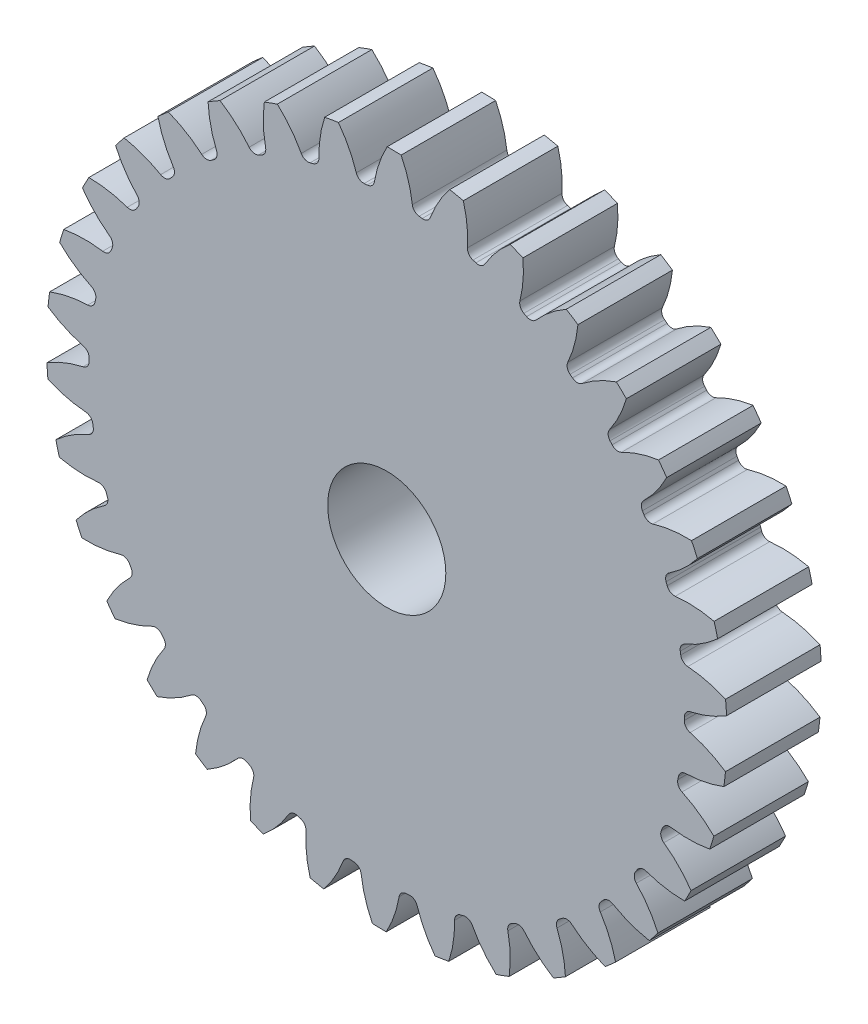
from build123d import *

# Parameters (mm, degrees)
SKETCH3_R         = 365.76
GEARBODY_DEPTH    = 101.6
TOOTHCUT_DEPTH    = 528.146388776
CIRPATTERN1_COUNT = 34
BOREDIA_R         = 63.5
BORE_DEPTH        = 12700


with BuildPart() as part:
    # Sketch3 → gearBody (new body)
    with BuildSketch(Plane.XY):
        Circle(SKETCH3_R)
    extrude(amount=GEARBODY_DEPTH)

    # Sketch2 → toothCut (cut, through all)
    with BuildSketch(Plane.XY):
        with BuildLine():
            ThreePointArc((319.92219067, -8.682944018), (319.963552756, -6.994748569), (319.996006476, -5.306358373))
            ThreePointArc((319.996006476, -5.306358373), (321.865714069, -0.204721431), (326.497626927, 2.635681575))
            ThreePointArc((326.497626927, 2.635681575), (346.81407078, 8.941212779), (365.76, 18.614339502))
            ThreePointArc((365.76, 18.614339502), (366.145874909, -8.004343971), (364.597098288, -34.580733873))
            ThreePointArc((364.597098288, -34.580733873), (346.091997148, -24.08888721), (326.070522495, -16.901525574))
            ThreePointArc((326.070522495, -16.901525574), (321.567163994, -13.861415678), (319.92219067, -8.682944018))
        make_face()
    toothcut = extrude(amount=TOOTHCUT_DEPTH, mode=Mode.SUBTRACT)

    # CirPattern1: toothCut ×34 about axis
    cirpattern1_axis = Axis((0, 0, 0), (0, 0, 1))
    for i in range(1, CIRPATTERN1_COUNT):
        add(toothcut.rotate(cirpattern1_axis, i * 360 / CIRPATTERN1_COUNT), mode=Mode.SUBTRACT)

    # boreDia → bore (cut, symmetric)
    with BuildSketch(Plane.XY):
        Circle(BOREDIA_R)
    extrude(amount=BORE_DEPTH, both=True, mode=Mode.SUBTRACT)


solid = part.part
